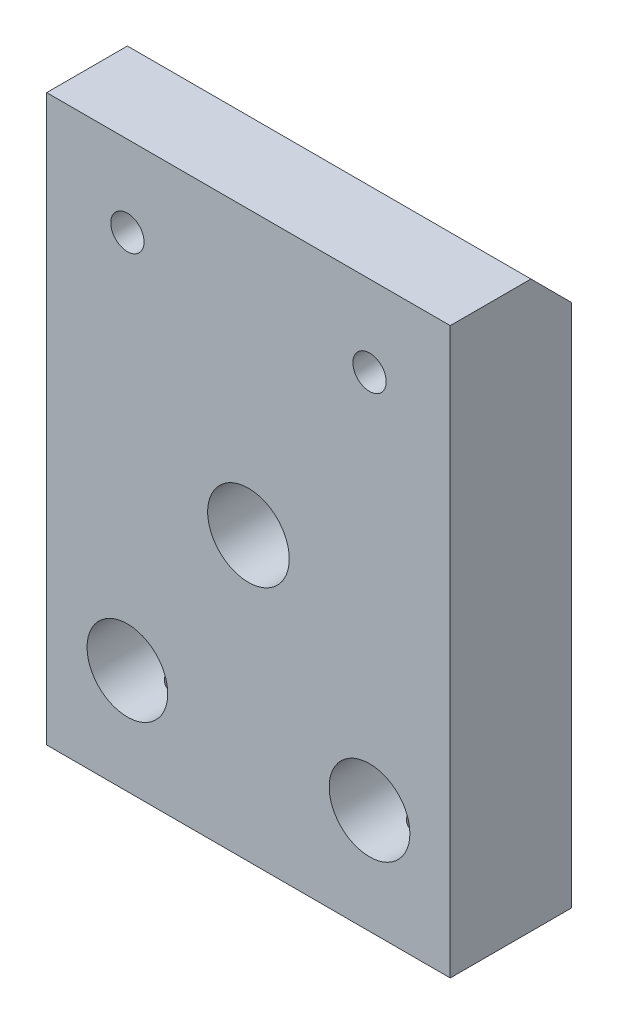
from build123d import *

# Parameters (mm, degrees)
ESQUISSE1_W             = 50
ESQUISSE1_H             = 70
ESQUISSE1_R             = 5
ESQUISSE1_R_2           = 5.055
ESQUISSE1_R_3           = 2.065
BASE_EXTRUSION_DEPTH    = 15
CHANFREIN3_SIZE         = 5
ENL_V_MAT_EXTRU_1_REACH = 77.829
ESQUISSE2_R             = 2.065


with BuildPart() as part:
    # Esquisse1 → Base-Extrusion (new body)
    with BuildSketch(Plane.XY):
        with Locations((0, 35)):
            Rectangle(ESQUISSE1_W, ESQUISSE1_H)
        with Locations((15, 13)):
            Circle(ESQUISSE1_R, mode=Mode.SUBTRACT)
        with Locations(Location((-15, 13, 0), (0, 0, 180))):
            Circle(ESQUISSE1_R, mode=Mode.SUBTRACT)
        with Locations((0, 35)):
            Circle(ESQUISSE1_R_2, mode=Mode.SUBTRACT)
        with Locations((-15, 60)):
            Circle(ESQUISSE1_R_3, mode=Mode.SUBTRACT)
        with Locations(Location((15, 60, 0), (0, 0, 180))):
            Circle(ESQUISSE1_R_3, mode=Mode.SUBTRACT)
    extrude(amount=BASE_EXTRUSION_DEPTH)

    # Chanfrein3
    chanfrein3_edges = [part.edges().sort_by_distance(p)[0] for p in [
        (0, 70, 0),
    ]]
    chamfer(chanfrein3_edges, length=CHANFREIN3_SIZE)

    # Esquisse2 → Enl_v. mat.-Extru.1 (cut, up to next)
    with BuildSketch(Plane.XZ, mode=Mode.PRIVATE) as enl_v_mat_extru_1_sk1:
        with Locations(Location((15, 7.5, 0), (0, 0, 270))):
            Circle(ESQUISSE2_R)
    enl_v_mat_extru_1_tool1 = extrude(enl_v_mat_extru_1_sk1.sketch, amount=-ENL_V_MAT_EXTRU_1_REACH, mode=Mode.PRIVATE) & part.part
    # Esquisse2 → Enl_v. mat.-Extru.1 (cut, up to next)
    with BuildSketch(Plane.XZ, mode=Mode.PRIVATE) as enl_v_mat_extru_1_sk2:
        with Locations(Location((-15, 7.5, 0), (0, 0, 270))):
            Circle(ESQUISSE2_R)
    enl_v_mat_extru_1_tool2 = extrude(enl_v_mat_extru_1_sk2.sketch, amount=-ENL_V_MAT_EXTRU_1_REACH, mode=Mode.PRIVATE) & part.part
    add(enl_v_mat_extru_1_tool1.solids().sort_by_distance((15, 0, 7.5))[0], mode=Mode.SUBTRACT)
    add(enl_v_mat_extru_1_tool2.solids().sort_by_distance((-15, 0, 7.5))[0], mode=Mode.SUBTRACT)


solid = part.part
